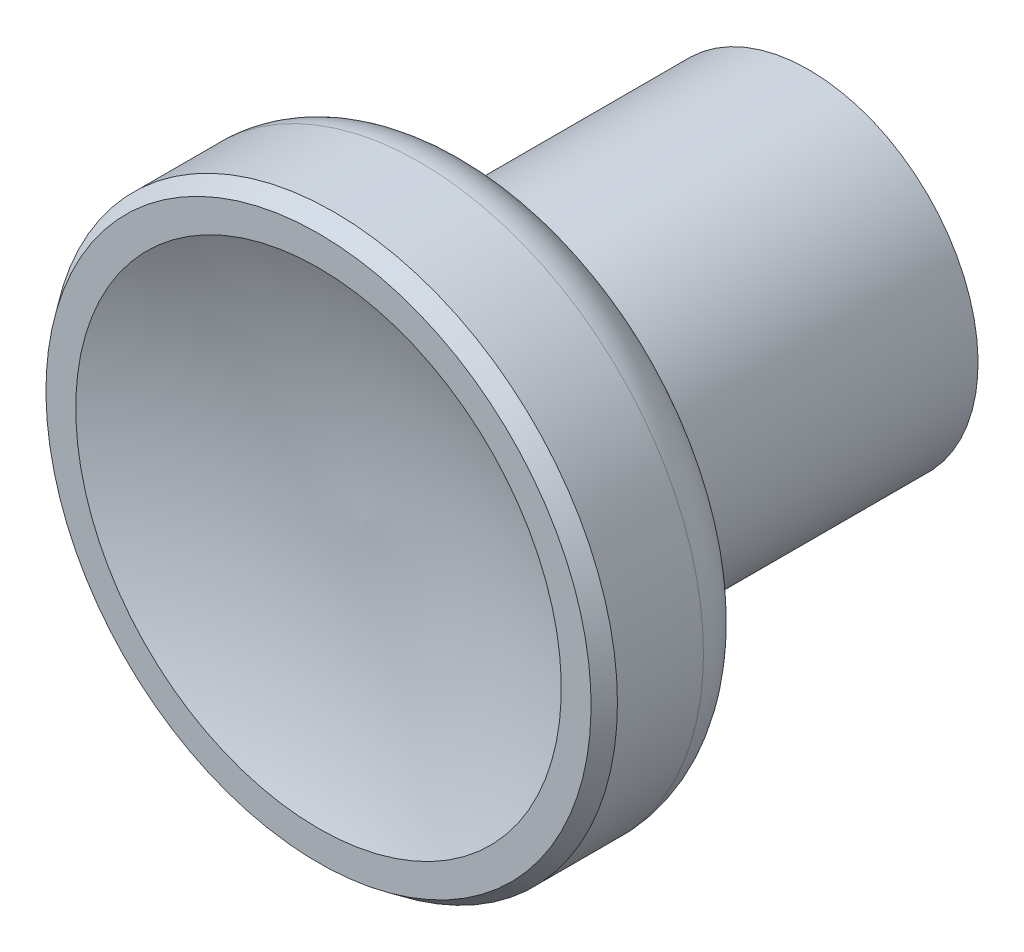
ISO-10303-21;
HEADER;
FILE_DESCRIPTION(('STEP AP214'),'2;1');
FILE_NAME('part.step','',(''),(''),'','','');
FILE_SCHEMA(('AUTOMOTIVE_DESIGN { 1 0 10303 214 1 1 1 1 }'));
ENDSEC;
DATA;
#1=APPLICATION_CONTEXT('core data for automotive mechanical design processes');
#2=APPLICATION_PROTOCOL_DEFINITION('international standard','automotive_design',2000,#1);
#3=PRODUCT_CONTEXT('',#1,'mechanical');
#4=PRODUCT('Part','Part','',(#3));
#5=PRODUCT_RELATED_PRODUCT_CATEGORY('part','',(#4));
#6=PRODUCT_DEFINITION_FORMATION('','',#4);
#7=PRODUCT_DEFINITION_CONTEXT('part definition',#1,'design');
#8=PRODUCT_DEFINITION('design','',#6,#7);
#9=PRODUCT_DEFINITION_SHAPE('','',#8);
#10=(LENGTH_UNIT() NAMED_UNIT(*) SI_UNIT(.MILLI.,.METRE.));
#11=(NAMED_UNIT(*) PLANE_ANGLE_UNIT() SI_UNIT($,.RADIAN.));
#12=(NAMED_UNIT(*) SI_UNIT($,.STERADIAN.) SOLID_ANGLE_UNIT());
#13=UNCERTAINTY_MEASURE_WITH_UNIT(LENGTH_MEASURE(1.E-05),#10,'distance_accuracy_value','');
#14=(GEOMETRIC_REPRESENTATION_CONTEXT(3) GLOBAL_UNCERTAINTY_ASSIGNED_CONTEXT((#13)) GLOBAL_UNIT_ASSIGNED_CONTEXT((#10,
#11,#12)) REPRESENTATION_CONTEXT('',''));
#15=CARTESIAN_POINT('',(0.,0.,0.));
#16=DIRECTION('',(0.,0.,1.));
#17=DIRECTION('',(1.,0.,0.));
#18=AXIS2_PLACEMENT_3D('',#15,#16,#17);
#19=CARTESIAN_POINT('',(9.25,0.,0.200000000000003));
#20=DIRECTION('',(0.,0.,1.));
#21=DIRECTION('',(0.,-1.,0.));
#22=AXIS2_PLACEMENT_3D('',#19,#20,#21);
#23=PLANE('',#22);
#24=CARTESIAN_POINT('',(0.,0.,0.200000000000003));
#25=DIRECTION('',(0.,0.,-1.));
#26=DIRECTION('',(0.,1.,0.));
#27=AXIS2_PLACEMENT_3D('',#24,#25,#26);
#28=CIRCLE('',#27,6.);
#29=CARTESIAN_POINT('',(0.,6.,0.200000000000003));
#30=VERTEX_POINT('',#29);
#31=EDGE_CURVE('E54',#30,#30,#28,.T.);
#32=ORIENTED_EDGE('',*,*,#31,.F.);
#33=EDGE_LOOP('',(#32));
#34=FACE_BOUND('',#33,.T.);
#35=CARTESIAN_POINT('',(0.,0.,0.200000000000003));
#36=DIRECTION('',(0.,0.,-1.));
#37=DIRECTION('',(0.,1.,0.));
#38=AXIS2_PLACEMENT_3D('',#35,#36,#37);
#39=CIRCLE('',#38,9.25);
#40=CARTESIAN_POINT('',(0.,9.25,0.200000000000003));
#41=VERTEX_POINT('',#40);
#42=EDGE_CURVE('E9',#41,#41,#39,.T.);
#43=ORIENTED_EDGE('',*,*,#42,.T.);
#44=EDGE_LOOP('',(#43));
#45=FACE_BOUND('',#44,.T.);
#46=ADVANCED_FACE('F14',(#34,#45),#23,.F.);
#47=CARTESIAN_POINT('',(0.,0.,-5.03212408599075));
#48=DIRECTION('',(0.,0.,-1.));
#49=DIRECTION('',(0.,1.,0.));
#50=AXIS2_PLACEMENT_3D('',#47,#48,#49);
#51=CYLINDRICAL_SURFACE('',#50,9.25);
#52=CARTESIAN_POINT('',(0.,0.,17.));
#53=DIRECTION('',(0.,0.,-1.));
#54=DIRECTION('',(0.,1.,0.));
#55=AXIS2_PLACEMENT_3D('',#52,#53,#54);
#56=CIRCLE('',#55,9.25);
#57=CARTESIAN_POINT('',(0.,9.25,17.));
#58=VERTEX_POINT('',#57);
#59=EDGE_CURVE('E20',#58,#58,#56,.T.);
#60=ORIENTED_EDGE('',*,*,#59,.T.);
#61=EDGE_LOOP('',(#60));
#62=FACE_BOUND('',#61,.T.);
#63=ORIENTED_EDGE('',*,*,#42,.F.);
#64=EDGE_LOOP('',(#63));
#65=FACE_BOUND('',#64,.T.);
#66=ADVANCED_FACE('F43',(#62,#65),#51,.T.);
#67=CARTESIAN_POINT('',(0.,0.,16.8985536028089));
#68=DIRECTION('',(0.,0.,-1.));
#69=DIRECTION('',(0.,1.,0.));
#70=AXIS2_PLACEMENT_3D('',#67,#68,#69);
#71=TOROIDAL_SURFACE('',#70,10.0001743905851,0.757002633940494);
#72=ORIENTED_EDGE('',*,*,#59,.F.);
#73=EDGE_LOOP('',(#72));
#74=FACE_BOUND('',#73,.T.);
#75=CARTESIAN_POINT('',(0.,0.,17.6315572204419));
#76=DIRECTION('',(0.,0.,-1.));
#77=DIRECTION('',(0.,1.,0.));
#78=AXIS2_PLACEMENT_3D('',#75,#76,#77);
#79=CIRCLE('',#78,9.81107472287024);
#80=CARTESIAN_POINT('',(0.,9.81107472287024,17.6315572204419));
#81=VERTEX_POINT('',#80);
#82=EDGE_CURVE('E84',#81,#81,#79,.T.);
#83=ORIENTED_EDGE('',*,*,#82,.T.);
#84=EDGE_LOOP('',(#83));
#85=FACE_BOUND('',#84,.T.);
#86=ADVANCED_FACE('F49',(#74,#85),#71,.F.);
#87=CARTESIAN_POINT('',(0.,0.,17.6315572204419));
#88=DIRECTION('',(0.,0.,1.));
#89=DIRECTION('',(0.,-1.,0.));
#90=AXIS2_PLACEMENT_3D('',#87,#88,#89);
#91=CONICAL_SURFACE('',#90,9.81107472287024,1.30899528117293);
#92=CARTESIAN_POINT('',(0.,0.,18.5601110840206));
#93=DIRECTION('',(0.,0.,-1.));
#94=DIRECTION('',(0.,1.,0.));
#95=AXIS2_PLACEMENT_3D('',#92,#93,#94);
#96=CIRCLE('',#95,13.2764619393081);
#97=CARTESIAN_POINT('',(0.,13.2764619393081,18.5601110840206));
#98=VERTEX_POINT('',#97);
#99=EDGE_CURVE('E81',#98,#98,#96,.T.);
#100=ORIENTED_EDGE('',*,*,#99,.T.);
#101=EDGE_LOOP('',(#100));
#102=FACE_BOUND('',#101,.T.);
#103=ORIENTED_EDGE('',*,*,#82,.F.);
#104=EDGE_LOOP('',(#103));
#105=FACE_BOUND('',#104,.T.);
#106=ADVANCED_FACE('F91',(#102,#105),#91,.T.);
#107=CARTESIAN_POINT('',(0.,0.,21.4578872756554));
#108=DIRECTION('',(0.,0.,-1.));
#109=DIRECTION('',(0.,1.,0.));
#110=AXIS2_PLACEMENT_3D('',#107,#108,#109);
#111=TOROIDAL_SURFACE('',#110,12.5,3.);
#112=CARTESIAN_POINT('',(0.,0.,21.4578872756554));
#113=DIRECTION('',(0.,0.,-1.));
#114=DIRECTION('',(0.,1.,0.));
#115=AXIS2_PLACEMENT_3D('',#112,#113,#114);
#116=CIRCLE('',#115,15.5);
#117=CARTESIAN_POINT('',(0.,15.5,21.4578872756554));
#118=VERTEX_POINT('',#117);
#119=EDGE_CURVE('E78',#118,#118,#116,.T.);
#120=ORIENTED_EDGE('',*,*,#119,.T.);
#121=EDGE_LOOP('',(#120));
#122=FACE_BOUND('',#121,.T.);
#123=ORIENTED_EDGE('',*,*,#99,.F.);
#124=EDGE_LOOP('',(#123));
#125=FACE_BOUND('',#124,.T.);
#126=ADVANCED_FACE('F96',(#122,#125),#111,.T.);
#127=CARTESIAN_POINT('',(0.,0.,-5.03212408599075));
#128=DIRECTION('',(0.,0.,-1.));
#129=DIRECTION('',(0.,1.,0.));
#130=AXIS2_PLACEMENT_3D('',#127,#128,#129);
#131=CYLINDRICAL_SURFACE('',#130,15.5);
#132=CARTESIAN_POINT('',(0.,0.,26.1604195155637));
#133=DIRECTION('',(0.,0.,-1.));
#134=DIRECTION('',(0.,1.,0.));
#135=AXIS2_PLACEMENT_3D('',#132,#133,#134);
#136=CIRCLE('',#135,15.5);
#137=CARTESIAN_POINT('',(0.,15.5,26.1604195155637));
#138=VERTEX_POINT('',#137);
#139=EDGE_CURVE('E75',#138,#138,#136,.T.);
#140=ORIENTED_EDGE('',*,*,#139,.T.);
#141=EDGE_LOOP('',(#140));
#142=FACE_BOUND('',#141,.T.);
#143=ORIENTED_EDGE('',*,*,#119,.F.);
#144=EDGE_LOOP('',(#143));
#145=FACE_BOUND('',#144,.T.);
#146=ADVANCED_FACE('F103',(#142,#145),#131,.T.);
#147=CARTESIAN_POINT('',(0.,0.,27.));
#148=DIRECTION('',(0.,0.,-1.));
#149=DIRECTION('',(0.,1.,0.));
#150=AXIS2_PLACEMENT_3D('',#147,#148,#149);
#151=CONICAL_SURFACE('',#150,14.8985964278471,0.621591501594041);
#152=ORIENTED_EDGE('',*,*,#139,.F.);
#153=EDGE_LOOP('',(#152));
#154=FACE_BOUND('',#153,.T.);
#155=CARTESIAN_POINT('',(0.,0.,27.));
#156=DIRECTION('',(0.,0.,-1.));
#157=DIRECTION('',(0.,1.,0.));
#158=AXIS2_PLACEMENT_3D('',#155,#156,#157);
#159=CIRCLE('',#158,14.8985964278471);
#160=CARTESIAN_POINT('',(0.,14.8985964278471,27.));
#161=VERTEX_POINT('',#160);
#162=EDGE_CURVE('E72',#161,#161,#159,.T.);
#163=ORIENTED_EDGE('',*,*,#162,.T.);
#164=EDGE_LOOP('',(#163));
#165=FACE_BOUND('',#164,.T.);
#166=ADVANCED_FACE('F38',(#154,#165),#151,.T.);
#167=CARTESIAN_POINT('',(14.8985964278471,0.,27.));
#168=DIRECTION('',(0.,0.,1.));
#169=DIRECTION('',(0.,-1.,0.));
#170=AXIS2_PLACEMENT_3D('',#167,#168,#169);
#171=PLANE('',#170);
#172=CARTESIAN_POINT('',(0.,0.,27.));
#173=DIRECTION('',(0.,0.,-1.));
#174=DIRECTION('',(0.,1.,0.));
#175=AXIS2_PLACEMENT_3D('',#172,#173,#174);
#176=CIRCLE('',#175,13.2712747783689);
#177=CARTESIAN_POINT('',(0.,13.2712747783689,27.));
#178=VERTEX_POINT('',#177);
#179=EDGE_CURVE('E69',#178,#178,#176,.T.);
#180=ORIENTED_EDGE('',*,*,#179,.T.);
#181=EDGE_LOOP('',(#180));
#182=FACE_BOUND('',#181,.T.);
#183=ORIENTED_EDGE('',*,*,#162,.F.);
#184=EDGE_LOOP('',(#183));
#185=FACE_BOUND('',#184,.T.);
#186=ADVANCED_FACE('F26',(#182,#185),#171,.T.);
#187=CARTESIAN_POINT('',(0.,1.00000000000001,54.4628043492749));
#188=DIRECTION('',(-1.,0.,0.));
#189=DIRECTION('',(0.,1.,0.));
#190=AXIS2_PLACEMENT_3D('',#187,#188,#189);
#191=CIRCLE('',#190,30.0797241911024);
#192=TRIMMED_CURVE('',#191,(PARAMETER_VALUE(-1.60404743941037)),
(PARAMETER_VALUE(1.60404743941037)),.T.,.PARAMETER.);
#193=CARTESIAN_POINT('',(0.,0.,54.4628043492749));
#194=DIRECTION('',(0.,0.,-1.));
#195=AXIS1_PLACEMENT('',#193,#194);
#196=SURFACE_OF_REVOLUTION('',#192,#195);
#197=ORIENTED_EDGE('',*,*,#179,.F.);
#198=EDGE_LOOP('',(#197));
#199=FACE_BOUND('',#198,.T.);
#200=CARTESIAN_POINT('',(0.,0.,24.3997072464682));
#201=VERTEX_POINT('',#200);
#202=VERTEX_LOOP('',#201);
#203=FACE_BOUND('',#202,.T.);
#204=ADVANCED_FACE('F23',(#199,#203),#196,.F.);
#205=CARTESIAN_POINT('',(4.99999999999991,0.,17.));
#206=DIRECTION('',(0.,0.,1.));
#207=DIRECTION('',(0.,-1.,0.));
#208=AXIS2_PLACEMENT_3D('',#205,#206,#207);
#209=PLANE('',#208);
#210=CARTESIAN_POINT('',(0.,0.,17.));
#211=DIRECTION('',(0.,0.,-1.));
#212=DIRECTION('',(0.,1.,0.));
#213=AXIS2_PLACEMENT_3D('',#210,#211,#212);
#214=CIRCLE('',#213,5.);
#215=CARTESIAN_POINT('',(0.,5.,17.));
#216=VERTEX_POINT('',#215);
#217=EDGE_CURVE('E66',#216,#216,#214,.T.);
#218=ORIENTED_EDGE('',*,*,#217,.T.);
#219=EDGE_LOOP('',(#218));
#220=FACE_BOUND('',#219,.T.);
#221=ADVANCED_FACE('F25',(#220),#209,.F.);
#222=CARTESIAN_POINT('',(0.,0.,-5.03212408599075));
#223=DIRECTION('',(0.,0.,-1.));
#224=DIRECTION('',(0.,1.,0.));
#225=AXIS2_PLACEMENT_3D('',#222,#223,#224);
#226=CYLINDRICAL_SURFACE('',#225,5.);
#227=ORIENTED_EDGE('',*,*,#217,.F.);
#228=EDGE_LOOP('',(#227));
#229=FACE_BOUND('',#228,.T.);
#230=CARTESIAN_POINT('',(0.,0.,0.));
#231=DIRECTION('',(0.,0.,-1.));
#232=DIRECTION('',(0.,1.,0.));
#233=AXIS2_PLACEMENT_3D('',#230,#231,#232);
#234=CIRCLE('',#233,5.);
#235=CARTESIAN_POINT('',(0.,5.,0.));
#236=VERTEX_POINT('',#235);
#237=EDGE_CURVE('E61',#236,#236,#234,.T.);
#238=ORIENTED_EDGE('',*,*,#237,.T.);
#239=EDGE_LOOP('',(#238));
#240=FACE_BOUND('',#239,.T.);
#241=ADVANCED_FACE('F35',(#229,#240),#226,.F.);
#242=CARTESIAN_POINT('',(5.99999999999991,0.,0.));
#243=DIRECTION('',(0.,0.,1.));
#244=DIRECTION('',(0.,-1.,0.));
#245=AXIS2_PLACEMENT_3D('',#242,#243,#244);
#246=PLANE('',#245);
#247=ORIENTED_EDGE('',*,*,#237,.F.);
#248=EDGE_LOOP('',(#247));
#249=FACE_BOUND('',#248,.T.);
#250=CARTESIAN_POINT('',(0.,0.,0.));
#251=DIRECTION('',(0.,0.,-1.));
#252=DIRECTION('',(0.,1.,0.));
#253=AXIS2_PLACEMENT_3D('',#250,#251,#252);
#254=CIRCLE('',#253,6.);
#255=CARTESIAN_POINT('',(0.,6.,0.));
#256=VERTEX_POINT('',#255);
#257=EDGE_CURVE('E58',#256,#256,#254,.T.);
#258=ORIENTED_EDGE('',*,*,#257,.T.);
#259=EDGE_LOOP('',(#258));
#260=FACE_BOUND('',#259,.T.);
#261=ADVANCED_FACE('F184',(#249,#260),#246,.F.);
#262=CARTESIAN_POINT('',(0.,0.,-5.03212408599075));
#263=DIRECTION('',(0.,0.,-1.));
#264=DIRECTION('',(0.,1.,0.));
#265=AXIS2_PLACEMENT_3D('',#262,#263,#264);
#266=CYLINDRICAL_SURFACE('',#265,6.);
#267=ORIENTED_EDGE('',*,*,#257,.F.);
#268=EDGE_LOOP('',(#267));
#269=FACE_BOUND('',#268,.T.);
#270=ORIENTED_EDGE('',*,*,#31,.T.);
#271=EDGE_LOOP('',(#270));
#272=FACE_BOUND('',#271,.T.);
#273=ADVANCED_FACE('F192',(#269,#272),#266,.T.);
#274=CLOSED_SHELL('',(#46,#66,#86,#106,#126,#146,#166,#186,#204,#221,#241,#261,#273));
#275=MANIFOLD_SOLID_BREP('B1',#274);
#276=ADVANCED_BREP_SHAPE_REPRESENTATION('',(#18,#275),#14);
#277=SHAPE_DEFINITION_REPRESENTATION(#9,#276);
ENDSEC;
END-ISO-10303-21;
